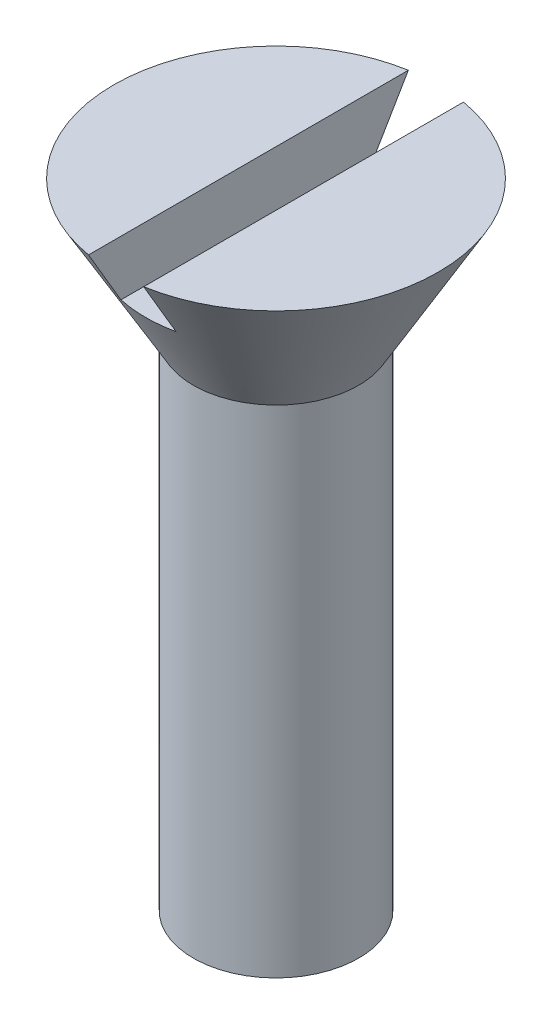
from build123d import *

# Parameters (mm, degrees)
SKETCH2_W          = 2
SKETCH2_H          = 14.407189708
CUT_EXTRUDE1_DEPTH = 2


with BuildPart() as part:
    # Sketch1 → Revolve1 (revolve)
    with BuildSketch(Plane.XY, mode=Mode.PRIVATE) as revolve1_sk:
        Polygon((0, 0), (3, 1.732050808), (3, 19.732050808), (5.886751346, 24.732050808), (0, 24.732050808), align=None)
    revolve(revolve1_sk.sketch.rotate(Axis((0, 37.313150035, 0), (0, -1, 0)), 180), axis=Axis((0, 37.313150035, 0), (0, -1, 0)))

    # Sketch2 → Cut-Extrude1 (cut)
    with BuildSketch(Plane(origin=(0, 24.732050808, 0), x_dir=(1, 0, 0), z_dir=(0, 1, 0))):
        Rectangle(SKETCH2_W, SKETCH2_H)
    extrude(amount=-CUT_EXTRUDE1_DEPTH, mode=Mode.SUBTRACT)


solid = part.part
